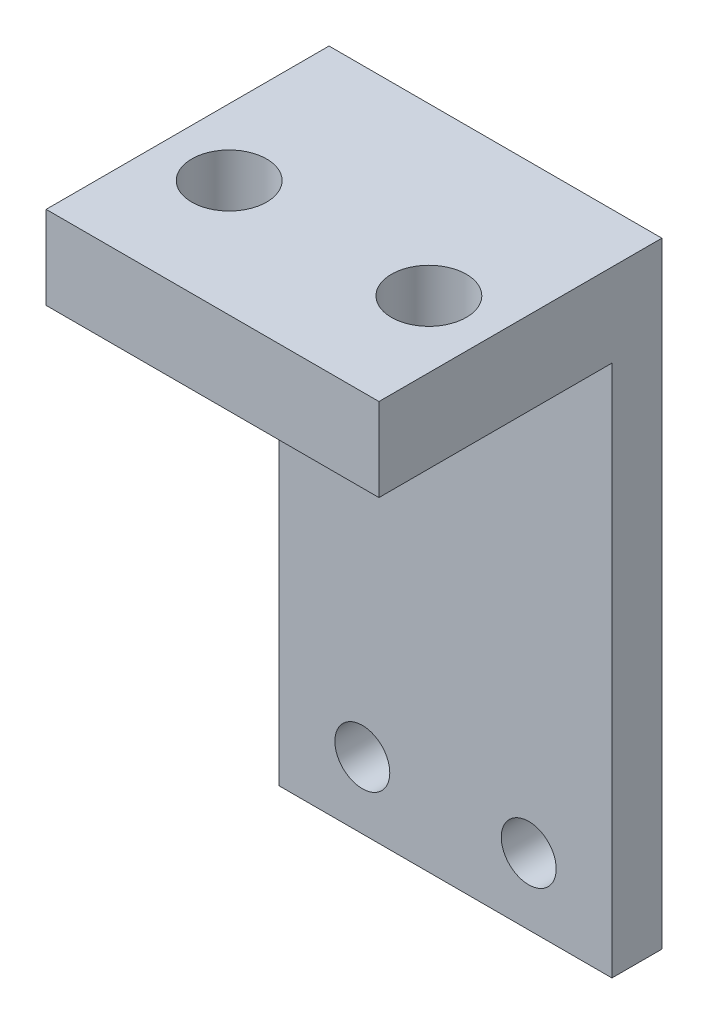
from build123d import *

# Parameters (mm, degrees)
SCHIZZO1_W                   = 20
SCHIZZO1_H                   = 5
ESTRUSIONE_ESTRUSIONE1_DEPTH = 17
SCHIZZO2_W                   = 20
SCHIZZO2_H                   = 3
ESTRUSIONE_ESTRUSIONE2_DEPTH = 32
FORO_FILETTATO_M4_1_D        = 3.3
FORO_PER_VITE_M4_1_D         = 4.5


with BuildPart() as part:
    # Schizzo1 → Estrusione-Estrusione1 (new body)
    with BuildSketch(Plane.XY):
        Rectangle(SCHIZZO1_W, SCHIZZO1_H)
    extrude(amount=ESTRUSIONE_ESTRUSIONE1_DEPTH)

    # Schizzo2 → Estrusione-Estrusione2 (add)
    with BuildSketch(Plane.XZ.offset(2.5)):
        with Locations((0, 1.5)):
            Rectangle(SCHIZZO2_W, SCHIZZO2_H)
    extrude(amount=ESTRUSIONE_ESTRUSIONE2_DEPTH)

    # Foro filettato M4-1 (through all)
    with Locations(Plane.XY.offset(3)):
        with Locations((-5, -30.5), (5, -30.5)):
            Hole(FORO_FILETTATO_M4_1_D / 2)

    # Foro per Vite M4-1 (through all)
    with Locations(Plane(origin=(0, 2.5, 0), x_dir=(1, 0, 0), z_dir=(0, 1, 0))):
        with Locations((-6, -10), (6, -10)):
            Hole(FORO_PER_VITE_M4_1_D / 2)


solid = part.part
